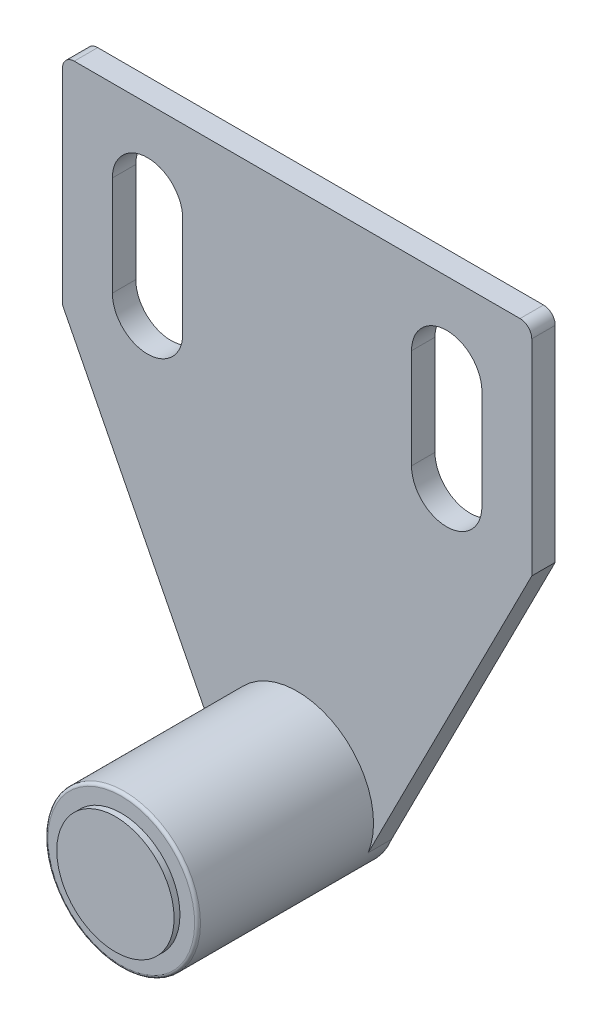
ISO-10303-21;
HEADER;
FILE_DESCRIPTION(('STEP AP214'),'2;1');
FILE_NAME('part.step','',(''),(''),'','','');
FILE_SCHEMA(('AUTOMOTIVE_DESIGN { 1 0 10303 214 1 1 1 1 }'));
ENDSEC;
DATA;
#1=APPLICATION_CONTEXT('core data for automotive mechanical design processes');
#2=APPLICATION_PROTOCOL_DEFINITION('international standard','automotive_design',2000,#1);
#3=PRODUCT_CONTEXT('',#1,'mechanical');
#4=PRODUCT('Part','Part','',(#3));
#5=PRODUCT_RELATED_PRODUCT_CATEGORY('part','',(#4));
#6=PRODUCT_DEFINITION_FORMATION('','',#4);
#7=PRODUCT_DEFINITION_CONTEXT('part definition',#1,'design');
#8=PRODUCT_DEFINITION('design','',#6,#7);
#9=PRODUCT_DEFINITION_SHAPE('','',#8);
#10=(LENGTH_UNIT() NAMED_UNIT(*) SI_UNIT(.MILLI.,.METRE.));
#11=(NAMED_UNIT(*) PLANE_ANGLE_UNIT() SI_UNIT($,.RADIAN.));
#12=(NAMED_UNIT(*) SI_UNIT($,.STERADIAN.) SOLID_ANGLE_UNIT());
#13=UNCERTAINTY_MEASURE_WITH_UNIT(LENGTH_MEASURE(1.E-05),#10,'distance_accuracy_value','');
#14=(GEOMETRIC_REPRESENTATION_CONTEXT(3) GLOBAL_UNCERTAINTY_ASSIGNED_CONTEXT((#13)) GLOBAL_UNIT_ASSIGNED_CONTEXT((#10,
#11,#12)) REPRESENTATION_CONTEXT('',''));
#15=CARTESIAN_POINT('',(0.,0.,0.));
#16=DIRECTION('',(0.,0.,1.));
#17=DIRECTION('',(1.,0.,0.));
#18=AXIS2_PLACEMENT_3D('',#15,#16,#17);
#19=CARTESIAN_POINT('',(0.0120447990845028,-28.5056632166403,16.75));
#20=DIRECTION('',(0.,0.,1.));
#21=DIRECTION('',(1.,0.,0.));
#22=AXIS2_PLACEMENT_3D('',#19,#20,#21);
#23=TOROIDAL_SURFACE('',#22,6.25,0.25);
#24=CARTESIAN_POINT('',(0.0120447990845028,-28.5056632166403,17.));
#25=DIRECTION('',(0.,0.,-1.));
#26=DIRECTION('',(-0.92862510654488,0.371019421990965,0.));
#27=AXIS2_PLACEMENT_3D('',#24,#25,#26);
#28=CIRCLE('',#27,6.25);
#29=CARTESIAN_POINT('',(5.81595171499,-30.8245346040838,17.));
#30=VERTEX_POINT('',#29);
#31=CARTESIAN_POINT('',(-6.2379552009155,-28.5056632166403,17.));
#32=VERTEX_POINT('',#31);
#33=EDGE_CURVE('E10',#30,#32,#28,.T.);
#34=ORIENTED_EDGE('',*,*,#33,.T.);
#35=CARTESIAN_POINT('',(-6.2379552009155,-28.5056632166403,16.75));
#36=DIRECTION('',(0.,-1.,0.));
#37=DIRECTION('',(-1.,0.,0.));
#38=AXIS2_PLACEMENT_3D('',#35,#36,#37);
#39=CIRCLE('',#38,0.25);
#40=CARTESIAN_POINT('',(-6.4879552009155,-28.5056632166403,16.75));
#41=VERTEX_POINT('',#40);
#42=EDGE_CURVE('E27',#32,#41,#39,.T.);
#43=ORIENTED_EDGE('',*,*,#42,.T.);
#44=CARTESIAN_POINT('',(0.0120447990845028,-28.5056632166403,16.75));
#45=DIRECTION('',(0.,0.,1.));
#46=DIRECTION('',(-0.92862510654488,0.371019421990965,0.));
#47=AXIS2_PLACEMENT_3D('',#44,#45,#46);
#48=CIRCLE('',#47,6.5);
#49=CARTESIAN_POINT('',(-5.78151644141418,-31.4526359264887,16.75));
#50=VERTEX_POINT('',#49);
#51=EDGE_CURVE('E382',#41,#50,#48,.T.);
#52=ORIENTED_EDGE('',*,*,#51,.T.);
#53=CARTESIAN_POINT('',(0.0120447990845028,-28.5056632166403,16.75));
#54=DIRECTION('',(0.,0.,1.));
#55=DIRECTION('',(-0.92862510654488,0.371019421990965,0.));
#56=AXIS2_PLACEMENT_3D('',#53,#54,#55);
#57=CIRCLE('',#56,6.5);
#58=CARTESIAN_POINT('',(6.04810799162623,-30.9172894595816,16.75));
#59=VERTEX_POINT('',#58);
#60=EDGE_CURVE('E314',#50,#59,#57,.T.);
#61=ORIENTED_EDGE('',*,*,#60,.T.);
#62=CARTESIAN_POINT('',(0.0120447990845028,-28.5056632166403,16.75));
#63=DIRECTION('',(0.,0.,1.));
#64=DIRECTION('',(-0.92862510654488,0.371019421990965,0.));
#65=AXIS2_PLACEMENT_3D('',#62,#63,#64);
#66=CIRCLE('',#65,6.5);
#67=EDGE_CURVE('E312',#59,#41,#66,.T.);
#68=ORIENTED_EDGE('',*,*,#67,.T.);
#69=ORIENTED_EDGE('',*,*,#42,.F.);
#70=CARTESIAN_POINT('',(0.0120447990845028,-28.5056632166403,17.));
#71=DIRECTION('',(0.,0.,-1.));
#72=DIRECTION('',(-0.92862510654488,0.371019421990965,0.));
#73=AXIS2_PLACEMENT_3D('',#70,#71,#72);
#74=CIRCLE('',#73,6.25);
#75=EDGE_CURVE('E315',#32,#30,#74,.T.);
#76=ORIENTED_EDGE('',*,*,#75,.T.);
#77=EDGE_LOOP('',(#34,#43,#52,#61,#68,#69,#76));
#78=FACE_BOUND('',#77,.T.);
#79=ADVANCED_FACE('F16',(#78),#23,.T.);
#80=CARTESIAN_POINT('',(0.012044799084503,-28.5056632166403,17.));
#81=DIRECTION('',(0.,0.,1.));
#82=DIRECTION('',(1.,0.,0.));
#83=AXIS2_PLACEMENT_3D('',#80,#81,#82);
#84=PLANE('',#83);
#85=ORIENTED_EDGE('',*,*,#33,.F.);
#86=ORIENTED_EDGE('',*,*,#75,.F.);
#87=EDGE_LOOP('',(#85,#86));
#88=FACE_BOUND('',#87,.T.);
#89=CARTESIAN_POINT('',(0.0120447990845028,-28.5056632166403,17.));
#90=DIRECTION('',(0.,0.,-1.));
#91=DIRECTION('',(1.,0.,0.));
#92=AXIS2_PLACEMENT_3D('',#89,#90,#91);
#93=CIRCLE('',#92,5.);
#94=CARTESIAN_POINT('',(5.0120447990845,-28.5056632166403,17.));
#95=VERTEX_POINT('',#94);
#96=CARTESIAN_POINT('',(-4.9879552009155,-28.5056632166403,17.));
#97=VERTEX_POINT('',#96);
#98=EDGE_CURVE('E242',#95,#97,#93,.T.);
#99=ORIENTED_EDGE('',*,*,#98,.T.);
#100=CARTESIAN_POINT('',(0.0120447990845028,-28.5056632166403,17.));
#101=DIRECTION('',(0.,0.,-1.));
#102=DIRECTION('',(1.,0.,0.));
#103=AXIS2_PLACEMENT_3D('',#100,#101,#102);
#104=CIRCLE('',#103,5.);
#105=EDGE_CURVE('E386',#97,#95,#104,.T.);
#106=ORIENTED_EDGE('',*,*,#105,.T.);
#107=EDGE_LOOP('',(#99,#106));
#108=FACE_BOUND('',#107,.T.);
#109=ADVANCED_FACE('F438',(#88,#108),#84,.T.);
#110=CARTESIAN_POINT('',(0.0120447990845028,-28.5056632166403,0.));
#111=DIRECTION('',(0.,0.,1.));
#112=DIRECTION('',(0.891317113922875,0.453380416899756,0.));
#113=AXIS2_PLACEMENT_3D('',#110,#111,#112);
#114=CYLINDRICAL_SURFACE('',#113,6.5);
#115=ORIENTED_EDGE('',*,*,#67,.F.);
#116=ORIENTED_EDGE('',*,*,#60,.F.);
#117=DIRECTION('',(0.,0.,-1.));
#118=VECTOR('',#117,1.);
#119=CARTESIAN_POINT('',(-5.78151644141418,-31.4526359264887,0.));
#120=LINE('',#119,#118);
#121=CARTESIAN_POINT('',(-5.78151644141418,-31.4526359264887,2.));
#122=VERTEX_POINT('',#121);
#123=EDGE_CURVE('E356',#50,#122,#120,.T.);
#124=ORIENTED_EDGE('',*,*,#123,.T.);
#125=DIRECTION('',(0.,0.,1.));
#126=VECTOR('',#125,1.);
#127=CARTESIAN_POINT('',(-5.78151644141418,-31.4526359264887,0.));
#128=LINE('',#127,#126);
#129=CARTESIAN_POINT('',(-5.78151644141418,-31.4526359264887,0.));
#130=VERTEX_POINT('',#129);
#131=EDGE_CURVE('E286',#130,#122,#128,.T.);
#132=ORIENTED_EDGE('',*,*,#131,.F.);
#133=CARTESIAN_POINT('',(0.0120447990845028,-28.5056632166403,0.));
#134=DIRECTION('',(0.,0.,-1.));
#135=DIRECTION('',(0.891317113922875,0.453380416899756,0.));
#136=AXIS2_PLACEMENT_3D('',#133,#134,#135);
#137=CIRCLE('',#136,6.5);
#138=CARTESIAN_POINT('',(6.04810799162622,-30.9172894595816,0.));
#139=VERTEX_POINT('',#138);
#140=EDGE_CURVE('E236',#139,#130,#137,.T.);
#141=ORIENTED_EDGE('',*,*,#140,.F.);
#142=DIRECTION('',(0.,0.,1.));
#143=VECTOR('',#142,1.);
#144=CARTESIAN_POINT('',(6.04810799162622,-30.9172894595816,0.));
#145=LINE('',#144,#143);
#146=CARTESIAN_POINT('',(6.04810799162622,-30.9172894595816,2.));
#147=VERTEX_POINT('',#146);
#148=EDGE_CURVE('E353',#139,#147,#145,.T.);
#149=ORIENTED_EDGE('',*,*,#148,.T.);
#150=CARTESIAN_POINT('',(0.0120447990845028,-28.5056632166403,2.));
#151=DIRECTION('',(0.,0.,-1.));
#152=DIRECTION('',(1.,0.,0.));
#153=AXIS2_PLACEMENT_3D('',#150,#151,#152);
#154=CIRCLE('',#153,6.5);
#155=EDGE_CURVE('E370',#122,#147,#154,.T.);
#156=ORIENTED_EDGE('',*,*,#155,.F.);
#157=ORIENTED_EDGE('',*,*,#123,.F.);
#158=ORIENTED_EDGE('',*,*,#51,.F.);
#159=EDGE_LOOP('',(#115,#116,#124,#132,#141,#149,#156,#157,#158));
#160=FACE_BOUND('',#159,.T.);
#161=ADVANCED_FACE('F434',(#160),#114,.T.);
#162=CARTESIAN_POINT('',(0.0120447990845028,-28.5056632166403,17.));
#163=DIRECTION('',(0.,0.,1.));
#164=DIRECTION('',(1.,0.,0.));
#165=AXIS2_PLACEMENT_3D('',#162,#163,#164);
#166=CYLINDRICAL_SURFACE('',#165,5.);
#167=CARTESIAN_POINT('',(0.0120447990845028,-28.5056632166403,17.5));
#168=DIRECTION('',(0.,0.,1.));
#169=DIRECTION('',(1.,0.,0.));
#170=AXIS2_PLACEMENT_3D('',#167,#168,#169);
#171=CIRCLE('',#170,5.);
#172=CARTESIAN_POINT('',(5.0120447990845,-28.5056632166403,17.5));
#173=VERTEX_POINT('',#172);
#174=CARTESIAN_POINT('',(-4.9879552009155,-28.5056632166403,17.5));
#175=VERTEX_POINT('',#174);
#176=EDGE_CURVE('E358',#173,#175,#171,.T.);
#177=ORIENTED_EDGE('',*,*,#176,.F.);
#178=CARTESIAN_POINT('',(0.0120447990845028,-28.5056632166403,17.5));
#179=DIRECTION('',(0.,0.,1.));
#180=DIRECTION('',(1.,0.,0.));
#181=AXIS2_PLACEMENT_3D('',#178,#179,#180);
#182=CIRCLE('',#181,5.);
#183=EDGE_CURVE('E361',#175,#173,#182,.T.);
#184=ORIENTED_EDGE('',*,*,#183,.F.);
#185=DIRECTION('',(0.,0.,-1.));
#186=VECTOR('',#185,1.);
#187=CARTESIAN_POINT('',(-4.9879552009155,-28.5056632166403,17.));
#188=LINE('',#187,#186);
#189=EDGE_CURVE('E357',#175,#97,#188,.T.);
#190=ORIENTED_EDGE('',*,*,#189,.T.);
#191=ORIENTED_EDGE('',*,*,#98,.F.);
#192=ORIENTED_EDGE('',*,*,#105,.F.);
#193=ORIENTED_EDGE('',*,*,#189,.F.);
#194=EDGE_LOOP('',(#177,#184,#190,#191,#192,#193));
#195=FACE_BOUND('',#194,.T.);
#196=ADVANCED_FACE('F447',(#195),#166,.T.);
#197=CARTESIAN_POINT('',(0.012044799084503,-28.5056632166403,17.5));
#198=DIRECTION('',(0.,0.,1.));
#199=DIRECTION('',(1.,0.,0.));
#200=AXIS2_PLACEMENT_3D('',#197,#198,#199);
#201=PLANE('',#200);
#202=ORIENTED_EDGE('',*,*,#176,.T.);
#203=ORIENTED_EDGE('',*,*,#183,.T.);
#204=EDGE_LOOP('',(#202,#203));
#205=FACE_BOUND('',#204,.T.);
#206=ADVANCED_FACE('F449',(#205),#201,.T.);
#207=CARTESIAN_POINT('',(-0.000749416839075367,-4.95028168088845,2.));
#208=DIRECTION('',(0.,0.,1.));
#209=DIRECTION('',(1.,0.,0.));
#210=AXIS2_PLACEMENT_3D('',#207,#208,#209);
#211=PLANE('',#210);
#212=ORIENTED_EDGE('',*,*,#155,.T.);
#213=DIRECTION('',(-0.453528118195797,-0.891241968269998,0.));
#214=VECTOR('',#213,1.);
#215=CARTESIAN_POINT('',(20.,-3.5,2.));
#216=LINE('',#215,#214);
#217=CARTESIAN_POINT('',(20.,-3.5,2.));
#218=VERTEX_POINT('',#217);
#219=EDGE_CURVE('E299',#218,#147,#216,.T.);
#220=ORIENTED_EDGE('',*,*,#219,.F.);
#221=DIRECTION('',(0.,-1.,0.));
#222=VECTOR('',#221,1.);
#223=CARTESIAN_POINT('',(20.,15.,2.));
#224=LINE('',#223,#222);
#225=CARTESIAN_POINT('',(20.,14.,2.));
#226=VERTEX_POINT('',#225);
#227=EDGE_CURVE('E276',#226,#218,#224,.T.);
#228=ORIENTED_EDGE('',*,*,#227,.F.);
#229=CARTESIAN_POINT('',(19.,14.,2.));
#230=DIRECTION('',(0.,0.,-1.));
#231=DIRECTION('',(0.707106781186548,0.707106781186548,0.));
#232=AXIS2_PLACEMENT_3D('',#229,#230,#231);
#233=CIRCLE('',#232,1.);
#234=CARTESIAN_POINT('',(19.,15.,2.));
#235=VERTEX_POINT('',#234);
#236=EDGE_CURVE('E258',#235,#226,#233,.T.);
#237=ORIENTED_EDGE('',*,*,#236,.F.);
#238=DIRECTION('',(1.,0.,0.));
#239=VECTOR('',#238,1.);
#240=CARTESIAN_POINT('',(-20.,15.,2.));
#241=LINE('',#240,#239);
#242=CARTESIAN_POINT('',(-19.,15.,2.));
#243=VERTEX_POINT('',#242);
#244=EDGE_CURVE('E290',#243,#235,#241,.T.);
#245=ORIENTED_EDGE('',*,*,#244,.F.);
#246=CARTESIAN_POINT('',(-19.,14.,2.));
#247=DIRECTION('',(0.,0.,-1.));
#248=DIRECTION('',(-0.707106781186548,0.707106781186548,0.));
#249=AXIS2_PLACEMENT_3D('',#246,#247,#248);
#250=CIRCLE('',#249,1.);
#251=CARTESIAN_POINT('',(-20.,14.,2.));
#252=VERTEX_POINT('',#251);
#253=EDGE_CURVE('E404',#252,#243,#250,.T.);
#254=ORIENTED_EDGE('',*,*,#253,.F.);
#255=DIRECTION('',(0.,1.,0.));
#256=VECTOR('',#255,1.);
#257=CARTESIAN_POINT('',(-20.,-3.5,2.));
#258=LINE('',#257,#256);
#259=CARTESIAN_POINT('',(-20.,-3.5,2.));
#260=VERTEX_POINT('',#259);
#261=EDGE_CURVE('E206',#260,#252,#258,.T.);
#262=ORIENTED_EDGE('',*,*,#261,.F.);
#263=DIRECTION('',(-0.453380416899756,0.891317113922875,0.));
#264=VECTOR('',#263,1.);
#265=CARTESIAN_POINT('',(-5.78151644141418,-31.4526359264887,2.));
#266=LINE('',#265,#264);
#267=EDGE_CURVE('E289',#122,#260,#266,.T.);
#268=ORIENTED_EDGE('',*,*,#267,.F.);
#269=EDGE_LOOP('',(#212,#220,#228,#237,#245,#254,#262,#268));
#270=FACE_BOUND('',#269,.T.);
#271=DIRECTION('',(0.,1.,0.));
#272=VECTOR('',#271,1.);
#273=CARTESIAN_POINT('',(9.75,-2.72514084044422,2.));
#274=LINE('',#273,#272);
#275=CARTESIAN_POINT('',(9.75,-0.5,2.));
#276=VERTEX_POINT('',#275);
#277=CARTESIAN_POINT('',(9.75,8.,2.));
#278=VERTEX_POINT('',#277);
#279=EDGE_CURVE('E248',#276,#278,#274,.T.);
#280=ORIENTED_EDGE('',*,*,#279,.T.);
#281=CARTESIAN_POINT('',(12.75,8.,2.));
#282=DIRECTION('',(0.,0.,-1.));
#283=DIRECTION('',(-1.,0.,0.));
#284=AXIS2_PLACEMENT_3D('',#281,#282,#283);
#285=CIRCLE('',#284,3.);
#286=CARTESIAN_POINT('',(15.75,8.,2.));
#287=VERTEX_POINT('',#286);
#288=EDGE_CURVE('E244',#278,#287,#285,.T.);
#289=ORIENTED_EDGE('',*,*,#288,.T.);
#290=DIRECTION('',(0.,-1.,0.));
#291=VECTOR('',#290,1.);
#292=CARTESIAN_POINT('',(15.75,1.52485915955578,2.));
#293=LINE('',#292,#291);
#294=CARTESIAN_POINT('',(15.75,-0.5,2.));
#295=VERTEX_POINT('',#294);
#296=EDGE_CURVE('E249',#287,#295,#293,.T.);
#297=ORIENTED_EDGE('',*,*,#296,.T.);
#298=CARTESIAN_POINT('',(12.75,-0.5,2.));
#299=DIRECTION('',(0.,0.,-1.));
#300=DIRECTION('',(1.,0.,0.));
#301=AXIS2_PLACEMENT_3D('',#298,#299,#300);
#302=CIRCLE('',#301,3.);
#303=EDGE_CURVE('E253',#295,#276,#302,.T.);
#304=ORIENTED_EDGE('',*,*,#303,.T.);
#305=EDGE_LOOP('',(#280,#289,#297,#304));
#306=FACE_BOUND('',#305,.T.);
#307=DIRECTION('',(0.,1.,0.));
#308=VECTOR('',#307,1.);
#309=CARTESIAN_POINT('',(-15.75,-2.72514084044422,2.));
#310=LINE('',#309,#308);
#311=CARTESIAN_POINT('',(-15.75,-0.5,2.));
#312=VERTEX_POINT('',#311);
#313=CARTESIAN_POINT('',(-15.75,8.,2.));
#314=VERTEX_POINT('',#313);
#315=EDGE_CURVE('E310',#312,#314,#310,.T.);
#316=ORIENTED_EDGE('',*,*,#315,.T.);
#317=CARTESIAN_POINT('',(-12.75,8.,2.));
#318=DIRECTION('',(0.,0.,-1.));
#319=DIRECTION('',(-1.,0.,0.));
#320=AXIS2_PLACEMENT_3D('',#317,#318,#319);
#321=CIRCLE('',#320,3.);
#322=CARTESIAN_POINT('',(-9.75,8.,2.));
#323=VERTEX_POINT('',#322);
#324=EDGE_CURVE('E321',#314,#323,#321,.T.);
#325=ORIENTED_EDGE('',*,*,#324,.T.);
#326=DIRECTION('',(0.,-1.,0.));
#327=VECTOR('',#326,1.);
#328=CARTESIAN_POINT('',(-9.75,1.52485915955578,2.));
#329=LINE('',#328,#327);
#330=CARTESIAN_POINT('',(-9.75,-0.5,2.));
#331=VERTEX_POINT('',#330);
#332=EDGE_CURVE('E317',#323,#331,#329,.T.);
#333=ORIENTED_EDGE('',*,*,#332,.T.);
#334=CARTESIAN_POINT('',(-12.75,-0.5,2.));
#335=DIRECTION('',(0.,0.,-1.));
#336=DIRECTION('',(1.,0.,0.));
#337=AXIS2_PLACEMENT_3D('',#334,#335,#336);
#338=CIRCLE('',#337,3.);
#339=EDGE_CURVE('E322',#331,#312,#338,.T.);
#340=ORIENTED_EDGE('',*,*,#339,.T.);
#341=EDGE_LOOP('',(#316,#325,#333,#340));
#342=FACE_BOUND('',#341,.T.);
#343=ADVANCED_FACE('F456',(#270,#306,#342),#211,.T.);
#344=CARTESIAN_POINT('',(-19.,14.,0.));
#345=DIRECTION('',(0.,0.,1.));
#346=DIRECTION('',(-0.707106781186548,0.707106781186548,0.));
#347=AXIS2_PLACEMENT_3D('',#344,#345,#346);
#348=CYLINDRICAL_SURFACE('',#347,1.);
#349=ORIENTED_EDGE('',*,*,#253,.T.);
#350=DIRECTION('',(0.,0.,-1.));
#351=VECTOR('',#350,1.);
#352=CARTESIAN_POINT('',(-19.,15.,0.));
#353=LINE('',#352,#351);
#354=CARTESIAN_POINT('',(-19.,15.,0.));
#355=VERTEX_POINT('',#354);
#356=EDGE_CURVE('E217',#243,#355,#353,.T.);
#357=ORIENTED_EDGE('',*,*,#356,.T.);
#358=CARTESIAN_POINT('',(-19.,14.,0.));
#359=DIRECTION('',(0.,0.,1.));
#360=DIRECTION('',(-0.707106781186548,0.707106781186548,0.));
#361=AXIS2_PLACEMENT_3D('',#358,#359,#360);
#362=CIRCLE('',#361,1.);
#363=CARTESIAN_POINT('',(-20.,14.,0.));
#364=VERTEX_POINT('',#363);
#365=EDGE_CURVE('E211',#355,#364,#362,.T.);
#366=ORIENTED_EDGE('',*,*,#365,.T.);
#367=DIRECTION('',(0.,0.,1.));
#368=VECTOR('',#367,1.);
#369=CARTESIAN_POINT('',(-20.,14.,0.));
#370=LINE('',#369,#368);
#371=EDGE_CURVE('E198',#364,#252,#370,.T.);
#372=ORIENTED_EDGE('',*,*,#371,.T.);
#373=EDGE_LOOP('',(#349,#357,#366,#372));
#374=FACE_BOUND('',#373,.T.);
#375=ADVANCED_FACE('F215',(#374),#348,.T.);
#376=CARTESIAN_POINT('',(-20.,-3.5,0.));
#377=DIRECTION('',(-1.,0.,0.));
#378=DIRECTION('',(0.,1.,0.));
#379=AXIS2_PLACEMENT_3D('',#376,#377,#378);
#380=PLANE('',#379);
#381=ORIENTED_EDGE('',*,*,#371,.F.);
#382=DIRECTION('',(0.,1.,0.));
#383=VECTOR('',#382,1.);
#384=CARTESIAN_POINT('',(-20.,-3.5,0.));
#385=LINE('',#384,#383);
#386=CARTESIAN_POINT('',(-20.,-3.5,0.));
#387=VERTEX_POINT('',#386);
#388=EDGE_CURVE('E203',#387,#364,#385,.T.);
#389=ORIENTED_EDGE('',*,*,#388,.F.);
#390=DIRECTION('',(0.,0.,1.));
#391=VECTOR('',#390,1.);
#392=CARTESIAN_POINT('',(-20.,-3.5,0.));
#393=LINE('',#392,#391);
#394=EDGE_CURVE('E212',#387,#260,#393,.T.);
#395=ORIENTED_EDGE('',*,*,#394,.T.);
#396=ORIENTED_EDGE('',*,*,#261,.T.);
#397=EDGE_LOOP('',(#381,#389,#395,#396));
#398=FACE_BOUND('',#397,.T.);
#399=ADVANCED_FACE('F200',(#398),#380,.T.);
#400=CARTESIAN_POINT('',(-0.000749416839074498,-4.95028168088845,0.));
#401=DIRECTION('',(0.,0.,1.));
#402=DIRECTION('',(1.,0.,0.));
#403=AXIS2_PLACEMENT_3D('',#400,#401,#402);
#404=PLANE('',#403);
#405=ORIENTED_EDGE('',*,*,#365,.F.);
#406=DIRECTION('',(1.,0.,0.));
#407=VECTOR('',#406,1.);
#408=CARTESIAN_POINT('',(-20.,15.,0.));
#409=LINE('',#408,#407);
#410=CARTESIAN_POINT('',(19.,15.,0.));
#411=VERTEX_POINT('',#410);
#412=EDGE_CURVE('E263',#355,#411,#409,.T.);
#413=ORIENTED_EDGE('',*,*,#412,.T.);
#414=CARTESIAN_POINT('',(19.,14.,0.));
#415=DIRECTION('',(0.,0.,1.));
#416=DIRECTION('',(0.707106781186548,0.707106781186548,0.));
#417=AXIS2_PLACEMENT_3D('',#414,#415,#416);
#418=CIRCLE('',#417,1.);
#419=CARTESIAN_POINT('',(20.,14.,0.));
#420=VERTEX_POINT('',#419);
#421=EDGE_CURVE('E284',#420,#411,#418,.T.);
#422=ORIENTED_EDGE('',*,*,#421,.F.);
#423=DIRECTION('',(0.,-1.,0.));
#424=VECTOR('',#423,1.);
#425=CARTESIAN_POINT('',(20.,15.,0.));
#426=LINE('',#425,#424);
#427=CARTESIAN_POINT('',(20.,-3.5,0.));
#428=VERTEX_POINT('',#427);
#429=EDGE_CURVE('E259',#420,#428,#426,.T.);
#430=ORIENTED_EDGE('',*,*,#429,.T.);
#431=DIRECTION('',(-0.453528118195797,-0.891241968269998,0.));
#432=VECTOR('',#431,1.);
#433=CARTESIAN_POINT('',(20.,-3.5,0.));
#434=LINE('',#433,#432);
#435=EDGE_CURVE('E264',#428,#139,#434,.T.);
#436=ORIENTED_EDGE('',*,*,#435,.T.);
#437=ORIENTED_EDGE('',*,*,#140,.T.);
#438=DIRECTION('',(-0.453380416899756,0.891317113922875,0.));
#439=VECTOR('',#438,1.);
#440=CARTESIAN_POINT('',(-5.78151644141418,-31.4526359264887,0.));
#441=LINE('',#440,#439);
#442=EDGE_CURVE('E228',#130,#387,#441,.T.);
#443=ORIENTED_EDGE('',*,*,#442,.T.);
#444=ORIENTED_EDGE('',*,*,#388,.T.);
#445=EDGE_LOOP('',(#405,#413,#422,#430,#436,#437,#443,#444));
#446=FACE_BOUND('',#445,.T.);
#447=DIRECTION('',(0.,-1.,0.));
#448=VECTOR('',#447,1.);
#449=CARTESIAN_POINT('',(-15.75,-2.72514084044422,0.));
#450=LINE('',#449,#448);
#451=CARTESIAN_POINT('',(-15.75,8.,0.));
#452=VERTEX_POINT('',#451);
#453=CARTESIAN_POINT('',(-15.75,-0.5,0.));
#454=VERTEX_POINT('',#453);
#455=EDGE_CURVE('E230',#452,#454,#450,.T.);
#456=ORIENTED_EDGE('',*,*,#455,.T.);
#457=CARTESIAN_POINT('',(-12.75,-0.5,0.));
#458=DIRECTION('',(0.,0.,1.));
#459=DIRECTION('',(1.,0.,0.));
#460=AXIS2_PLACEMENT_3D('',#457,#458,#459);
#461=CIRCLE('',#460,3.);
#462=CARTESIAN_POINT('',(-9.75,-0.5,0.));
#463=VERTEX_POINT('',#462);
#464=EDGE_CURVE('E20',#454,#463,#461,.T.);
#465=ORIENTED_EDGE('',*,*,#464,.T.);
#466=DIRECTION('',(0.,1.,0.));
#467=VECTOR('',#466,1.);
#468=CARTESIAN_POINT('',(-9.75,1.52485915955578,0.));
#469=LINE('',#468,#467);
#470=CARTESIAN_POINT('',(-9.75,8.,0.));
#471=VERTEX_POINT('',#470);
#472=EDGE_CURVE('E268',#463,#471,#469,.T.);
#473=ORIENTED_EDGE('',*,*,#472,.T.);
#474=CARTESIAN_POINT('',(-12.75,8.,0.));
#475=DIRECTION('',(0.,0.,1.));
#476=DIRECTION('',(-1.,0.,0.));
#477=AXIS2_PLACEMENT_3D('',#474,#475,#476);
#478=CIRCLE('',#477,3.);
#479=EDGE_CURVE('E265',#471,#452,#478,.T.);
#480=ORIENTED_EDGE('',*,*,#479,.T.);
#481=EDGE_LOOP('',(#456,#465,#473,#480));
#482=FACE_BOUND('',#481,.T.);
#483=DIRECTION('',(0.,-1.,0.));
#484=VECTOR('',#483,1.);
#485=CARTESIAN_POINT('',(9.75,-2.72514084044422,0.));
#486=LINE('',#485,#484);
#487=CARTESIAN_POINT('',(9.75,8.,0.));
#488=VERTEX_POINT('',#487);
#489=CARTESIAN_POINT('',(9.75,-0.5,0.));
#490=VERTEX_POINT('',#489);
#491=EDGE_CURVE('E269',#488,#490,#486,.T.);
#492=ORIENTED_EDGE('',*,*,#491,.T.);
#493=CARTESIAN_POINT('',(12.75,-0.5,0.));
#494=DIRECTION('',(0.,0.,1.));
#495=DIRECTION('',(1.,0.,0.));
#496=AXIS2_PLACEMENT_3D('',#493,#494,#495);
#497=CIRCLE('',#496,3.);
#498=CARTESIAN_POINT('',(15.75,-0.5,0.));
#499=VERTEX_POINT('',#498);
#500=EDGE_CURVE('E291',#490,#499,#497,.T.);
#501=ORIENTED_EDGE('',*,*,#500,.T.);
#502=DIRECTION('',(0.,1.,0.));
#503=VECTOR('',#502,1.);
#504=CARTESIAN_POINT('',(15.75,1.52485915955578,0.));
#505=LINE('',#504,#503);
#506=CARTESIAN_POINT('',(15.75,8.,0.));
#507=VERTEX_POINT('',#506);
#508=EDGE_CURVE('E257',#499,#507,#505,.T.);
#509=ORIENTED_EDGE('',*,*,#508,.T.);
#510=CARTESIAN_POINT('',(12.75,8.,0.));
#511=DIRECTION('',(0.,0.,1.));
#512=DIRECTION('',(-1.,0.,0.));
#513=AXIS2_PLACEMENT_3D('',#510,#511,#512);
#514=CIRCLE('',#513,3.);
#515=EDGE_CURVE('E254',#507,#488,#514,.T.);
#516=ORIENTED_EDGE('',*,*,#515,.T.);
#517=EDGE_LOOP('',(#492,#501,#509,#516));
#518=FACE_BOUND('',#517,.T.);
#519=ADVANCED_FACE('F224',(#446,#482,#518),#404,.F.);
#520=CARTESIAN_POINT('',(19.,14.,0.));
#521=DIRECTION('',(0.,0.,1.));
#522=DIRECTION('',(0.707106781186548,0.707106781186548,0.));
#523=AXIS2_PLACEMENT_3D('',#520,#521,#522);
#524=CYLINDRICAL_SURFACE('',#523,1.);
#525=ORIENTED_EDGE('',*,*,#236,.T.);
#526=DIRECTION('',(0.,0.,-1.));
#527=VECTOR('',#526,1.);
#528=CARTESIAN_POINT('',(20.,14.,0.));
#529=LINE('',#528,#527);
#530=EDGE_CURVE('E338',#226,#420,#529,.T.);
#531=ORIENTED_EDGE('',*,*,#530,.T.);
#532=ORIENTED_EDGE('',*,*,#421,.T.);
#533=DIRECTION('',(0.,0.,1.));
#534=VECTOR('',#533,1.);
#535=CARTESIAN_POINT('',(19.,15.,0.));
#536=LINE('',#535,#534);
#537=EDGE_CURVE('E280',#411,#235,#536,.T.);
#538=ORIENTED_EDGE('',*,*,#537,.T.);
#539=EDGE_LOOP('',(#525,#531,#532,#538));
#540=FACE_BOUND('',#539,.T.);
#541=ADVANCED_FACE('F513',(#540),#524,.T.);
#542=CARTESIAN_POINT('',(20.,15.,0.));
#543=DIRECTION('',(1.,0.,0.));
#544=DIRECTION('',(0.,1.,0.));
#545=AXIS2_PLACEMENT_3D('',#542,#543,#544);
#546=PLANE('',#545);
#547=ORIENTED_EDGE('',*,*,#530,.F.);
#548=ORIENTED_EDGE('',*,*,#227,.T.);
#549=DIRECTION('',(0.,0.,1.));
#550=VECTOR('',#549,1.);
#551=CARTESIAN_POINT('',(20.,-3.5,0.));
#552=LINE('',#551,#550);
#553=EDGE_CURVE('E295',#428,#218,#552,.T.);
#554=ORIENTED_EDGE('',*,*,#553,.F.);
#555=ORIENTED_EDGE('',*,*,#429,.F.);
#556=EDGE_LOOP('',(#547,#548,#554,#555));
#557=FACE_BOUND('',#556,.T.);
#558=ADVANCED_FACE('F476',(#557),#546,.T.);
#559=CARTESIAN_POINT('',(-15.75,-0.5,2.));
#560=DIRECTION('',(-1.,0.,0.));
#561=DIRECTION('',(0.,1.,0.));
#562=AXIS2_PLACEMENT_3D('',#559,#560,#561);
#563=PLANE('',#562);
#564=ORIENTED_EDGE('',*,*,#315,.F.);
#565=DIRECTION('',(0.,0.,-1.));
#566=VECTOR('',#565,1.);
#567=CARTESIAN_POINT('',(-15.75,-0.5,2.));
#568=LINE('',#567,#566);
#569=EDGE_CURVE('E281',#312,#454,#568,.T.);
#570=ORIENTED_EDGE('',*,*,#569,.T.);
#571=ORIENTED_EDGE('',*,*,#455,.F.);
#572=DIRECTION('',(0.,0.,-1.));
#573=VECTOR('',#572,1.);
#574=CARTESIAN_POINT('',(-15.75,8.,2.));
#575=LINE('',#574,#573);
#576=EDGE_CURVE('E381',#314,#452,#575,.T.);
#577=ORIENTED_EDGE('',*,*,#576,.F.);
#578=EDGE_LOOP('',(#564,#570,#571,#577));
#579=FACE_BOUND('',#578,.T.);
#580=ADVANCED_FACE('F472',(#579),#563,.F.);
#581=CARTESIAN_POINT('',(-12.75,-0.5,2.));
#582=DIRECTION('',(0.,0.,-1.));
#583=DIRECTION('',(1.,0.,0.));
#584=AXIS2_PLACEMENT_3D('',#581,#582,#583);
#585=CYLINDRICAL_SURFACE('',#584,3.);
#586=ORIENTED_EDGE('',*,*,#339,.F.);
#587=DIRECTION('',(0.,0.,-1.));
#588=VECTOR('',#587,1.);
#589=CARTESIAN_POINT('',(-9.75,-0.5,2.));
#590=LINE('',#589,#588);
#591=EDGE_CURVE('E331',#331,#463,#590,.T.);
#592=ORIENTED_EDGE('',*,*,#591,.T.);
#593=ORIENTED_EDGE('',*,*,#464,.F.);
#594=ORIENTED_EDGE('',*,*,#569,.F.);
#595=EDGE_LOOP('',(#586,#592,#593,#594));
#596=FACE_BOUND('',#595,.T.);
#597=ADVANCED_FACE('F475',(#596),#585,.F.);
#598=CARTESIAN_POINT('',(-9.75,8.,2.));
#599=DIRECTION('',(1.,0.,0.));
#600=DIRECTION('',(0.,1.,0.));
#601=AXIS2_PLACEMENT_3D('',#598,#599,#600);
#602=PLANE('',#601);
#603=ORIENTED_EDGE('',*,*,#332,.F.);
#604=DIRECTION('',(0.,0.,-1.));
#605=VECTOR('',#604,1.);
#606=CARTESIAN_POINT('',(-9.75,8.,2.));
#607=LINE('',#606,#605);
#608=EDGE_CURVE('E398',#323,#471,#607,.T.);
#609=ORIENTED_EDGE('',*,*,#608,.T.);
#610=ORIENTED_EDGE('',*,*,#472,.F.);
#611=ORIENTED_EDGE('',*,*,#591,.F.);
#612=EDGE_LOOP('',(#603,#609,#610,#611));
#613=FACE_BOUND('',#612,.T.);
#614=ADVANCED_FACE('F18',(#613),#602,.F.);
#615=CARTESIAN_POINT('',(-12.75,8.,2.));
#616=DIRECTION('',(0.,0.,-1.));
#617=DIRECTION('',(-1.,0.,0.));
#618=AXIS2_PLACEMENT_3D('',#615,#616,#617);
#619=CYLINDRICAL_SURFACE('',#618,3.);
#620=ORIENTED_EDGE('',*,*,#324,.F.);
#621=ORIENTED_EDGE('',*,*,#576,.T.);
#622=ORIENTED_EDGE('',*,*,#479,.F.);
#623=ORIENTED_EDGE('',*,*,#608,.F.);
#624=EDGE_LOOP('',(#620,#621,#622,#623));
#625=FACE_BOUND('',#624,.T.);
#626=ADVANCED_FACE('F478',(#625),#619,.F.);
#627=CARTESIAN_POINT('',(9.75,-0.5,2.));
#628=DIRECTION('',(-1.,0.,0.));
#629=DIRECTION('',(0.,1.,0.));
#630=AXIS2_PLACEMENT_3D('',#627,#628,#629);
#631=PLANE('',#630);
#632=ORIENTED_EDGE('',*,*,#279,.F.);
#633=DIRECTION('',(0.,0.,-1.));
#634=VECTOR('',#633,1.);
#635=CARTESIAN_POINT('',(9.75,-0.5,2.));
#636=LINE('',#635,#634);
#637=EDGE_CURVE('E273',#276,#490,#636,.T.);
#638=ORIENTED_EDGE('',*,*,#637,.T.);
#639=ORIENTED_EDGE('',*,*,#491,.F.);
#640=DIRECTION('',(0.,0.,-1.));
#641=VECTOR('',#640,1.);
#642=CARTESIAN_POINT('',(9.75,8.,2.));
#643=LINE('',#642,#641);
#644=EDGE_CURVE('E303',#278,#488,#643,.T.);
#645=ORIENTED_EDGE('',*,*,#644,.F.);
#646=EDGE_LOOP('',(#632,#638,#639,#645));
#647=FACE_BOUND('',#646,.T.);
#648=ADVANCED_FACE('F481',(#647),#631,.F.);
#649=CARTESIAN_POINT('',(12.75,-0.5,2.));
#650=DIRECTION('',(0.,0.,-1.));
#651=DIRECTION('',(1.,0.,0.));
#652=AXIS2_PLACEMENT_3D('',#649,#650,#651);
#653=CYLINDRICAL_SURFACE('',#652,3.);
#654=ORIENTED_EDGE('',*,*,#303,.F.);
#655=DIRECTION('',(0.,0.,-1.));
#656=VECTOR('',#655,1.);
#657=CARTESIAN_POINT('',(15.75,-0.5,2.));
#658=LINE('',#657,#656);
#659=EDGE_CURVE('E270',#295,#499,#658,.T.);
#660=ORIENTED_EDGE('',*,*,#659,.T.);
#661=ORIENTED_EDGE('',*,*,#500,.F.);
#662=ORIENTED_EDGE('',*,*,#637,.F.);
#663=EDGE_LOOP('',(#654,#660,#661,#662));
#664=FACE_BOUND('',#663,.T.);
#665=ADVANCED_FACE('F487',(#664),#653,.F.);
#666=CARTESIAN_POINT('',(15.75,8.,2.));
#667=DIRECTION('',(1.,0.,0.));
#668=DIRECTION('',(0.,0.,1.));
#669=AXIS2_PLACEMENT_3D('',#666,#667,#668);
#670=PLANE('',#669);
#671=ORIENTED_EDGE('',*,*,#296,.F.);
#672=DIRECTION('',(0.,0.,-1.));
#673=VECTOR('',#672,1.);
#674=CARTESIAN_POINT('',(15.75,8.,2.));
#675=LINE('',#674,#673);
#676=EDGE_CURVE('E274',#287,#507,#675,.T.);
#677=ORIENTED_EDGE('',*,*,#676,.T.);
#678=ORIENTED_EDGE('',*,*,#508,.F.);
#679=ORIENTED_EDGE('',*,*,#659,.F.);
#680=EDGE_LOOP('',(#671,#677,#678,#679));
#681=FACE_BOUND('',#680,.T.);
#682=ADVANCED_FACE('F483',(#681),#670,.F.);
#683=CARTESIAN_POINT('',(12.75,8.,2.));
#684=DIRECTION('',(0.,0.,-1.));
#685=DIRECTION('',(-1.,0.,0.));
#686=AXIS2_PLACEMENT_3D('',#683,#684,#685);
#687=CYLINDRICAL_SURFACE('',#686,3.);
#688=ORIENTED_EDGE('',*,*,#288,.F.);
#689=ORIENTED_EDGE('',*,*,#644,.T.);
#690=ORIENTED_EDGE('',*,*,#515,.F.);
#691=ORIENTED_EDGE('',*,*,#676,.F.);
#692=EDGE_LOOP('',(#688,#689,#690,#691));
#693=FACE_BOUND('',#692,.T.);
#694=ADVANCED_FACE('F486',(#693),#687,.F.);
#695=CARTESIAN_POINT('',(20.,-3.5,0.));
#696=DIRECTION('',(0.891241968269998,-0.453528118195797,0.));
#697=DIRECTION('',(0.,0.,-1.));
#698=AXIS2_PLACEMENT_3D('',#695,#696,#697);
#699=PLANE('',#698);
#700=ORIENTED_EDGE('',*,*,#219,.T.);
#701=ORIENTED_EDGE('',*,*,#148,.F.);
#702=ORIENTED_EDGE('',*,*,#435,.F.);
#703=ORIENTED_EDGE('',*,*,#553,.T.);
#704=EDGE_LOOP('',(#700,#701,#702,#703));
#705=FACE_BOUND('',#704,.T.);
#706=ADVANCED_FACE('F491',(#705),#699,.T.);
#707=CARTESIAN_POINT('',(-5.78151644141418,-31.4526359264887,0.));
#708=DIRECTION('',(-0.891317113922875,-0.453380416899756,0.));
#709=DIRECTION('',(-0.453380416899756,0.891317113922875,0.));
#710=AXIS2_PLACEMENT_3D('',#707,#708,#709);
#711=PLANE('',#710);
#712=ORIENTED_EDGE('',*,*,#267,.T.);
#713=ORIENTED_EDGE('',*,*,#394,.F.);
#714=ORIENTED_EDGE('',*,*,#442,.F.);
#715=ORIENTED_EDGE('',*,*,#131,.T.);
#716=EDGE_LOOP('',(#712,#713,#714,#715));
#717=FACE_BOUND('',#716,.T.);
#718=ADVANCED_FACE('F494',(#717),#711,.T.);
#719=CARTESIAN_POINT('',(-20.,15.,0.));
#720=DIRECTION('',(0.,1.,0.));
#721=DIRECTION('',(1.,0.,0.));
#722=AXIS2_PLACEMENT_3D('',#719,#720,#721);
#723=PLANE('',#722);
#724=ORIENTED_EDGE('',*,*,#356,.F.);
#725=ORIENTED_EDGE('',*,*,#244,.T.);
#726=ORIENTED_EDGE('',*,*,#537,.F.);
#727=ORIENTED_EDGE('',*,*,#412,.F.);
#728=EDGE_LOOP('',(#724,#725,#726,#727));
#729=FACE_BOUND('',#728,.T.);
#730=ADVANCED_FACE('F497',(#729),#723,.T.);
#731=CLOSED_SHELL('',(#79,#109,#161,#196,#206,#343,#375,#399,#519,#541,#558,#580,#597,#614,#626,
#648,#665,#682,#694,#706,#718,#730));
#732=MANIFOLD_SOLID_BREP('B1',#731);
#733=ADVANCED_BREP_SHAPE_REPRESENTATION('',(#18,#732),#14);
#734=SHAPE_DEFINITION_REPRESENTATION(#9,#733);
ENDSEC;
END-ISO-10303-21;
